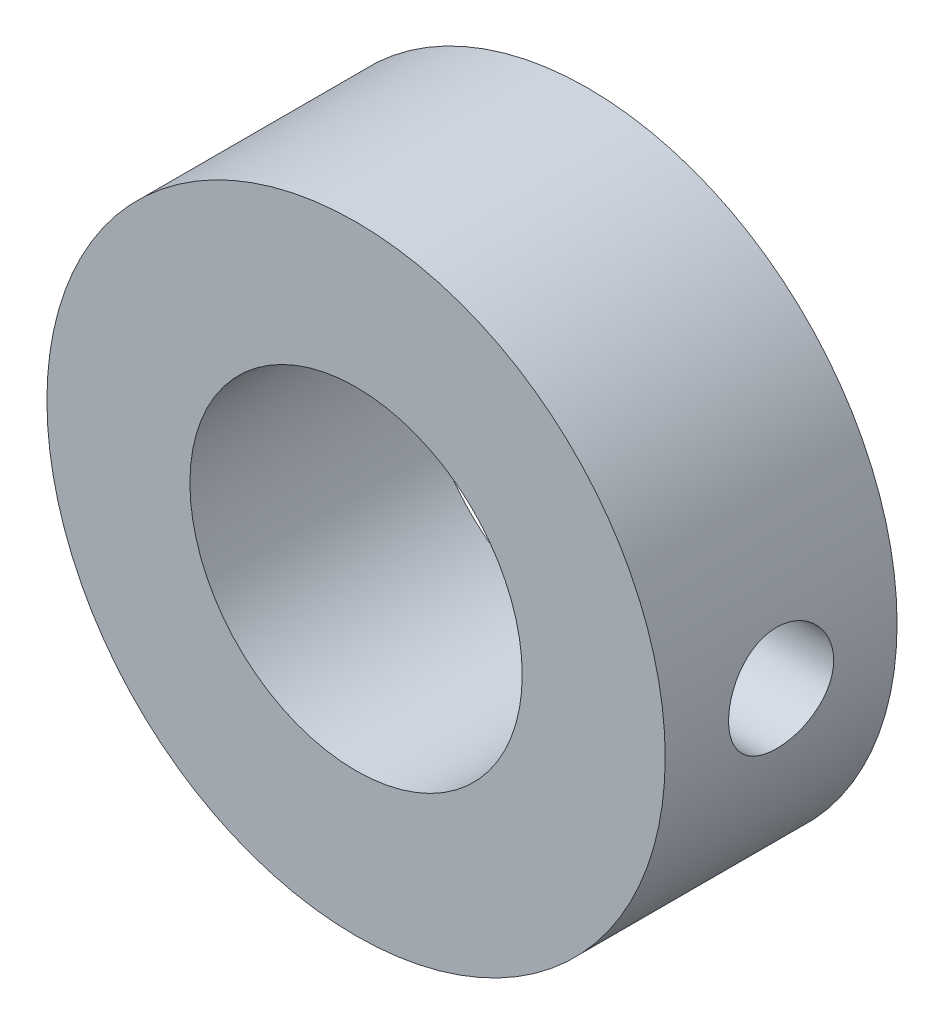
from build123d import *

# Parameters (mm, degrees)
ESQUISSE1_R                 = 20
ESQUISSE1_R_2               = 10.75
EXTRUSION1_DEPTH            = 7.5
TROU_TARAUD_M8X1_251_REACH  = 47.346
TROU_TARAUD_M8X1_251_BORE_R = 3.4


with BuildPart() as part:
    # Esquisse1 → Extrusion1 (new, symmetric)
    with BuildSketch(Plane.XY):
        Circle(ESQUISSE1_R)
        Circle(ESQUISSE1_R_2, mode=Mode.SUBTRACT)
    extrude(amount=EXTRUSION1_DEPTH, both=True)

    # Trou taraud_ M8x1.251 bore (on position points) → Trou taraud_ M8x1.251 (cut, up to next)
    with BuildSketch(Plane.YZ.offset(20), mode=Mode.PRIVATE) as trou_taraud_m8x1_251_sk1:
        Circle(TROU_TARAUD_M8X1_251_BORE_R)
    trou_taraud_m8x1_251_tool1 = extrude(trou_taraud_m8x1_251_sk1.sketch, amount=-TROU_TARAUD_M8X1_251_REACH, mode=Mode.PRIVATE) & part.part
    add(trou_taraud_m8x1_251_tool1.solids().sort_by_distance((20, 0, 0))[0], mode=Mode.SUBTRACT)


solid = part.part
